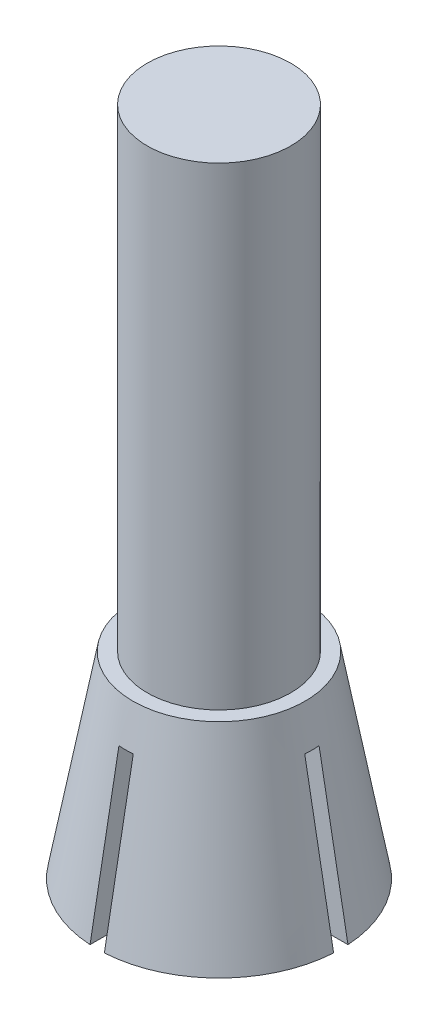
from build123d import *

# Parameters (mm, degrees)
ENL_V_MAT_EXTRU_1_DEPTH = 5.5


with BuildPart() as part:
    # Esquisse1 → R_volution1 (revolve)
    with BuildSketch(Plane.XY, mode=Mode.PRIVATE) as r_volution1_sk:
        Polygon((0, 6.75), (0, 23.35), (2.5, 23.35), (2.5, 6.85), (3, 6.85), (4.25, 0), (1.57, 0), (1.57, 6.75), align=None)
    revolve(r_volution1_sk.sketch.rotate(Axis((0, 0, 0), (0, 1, 0)), 90), axis=Axis((0, 0, 0), (0, 1, 0)))

    # Esquisse2 → Enl_v. mat.-Extru.1 (cut)
    with BuildSketch(Plane.XZ):
        Polygon((-0.25, 0.25), (-0.25, 5), (0.25, 5), (0.25, 0.25), (5, 0.25), (5, -0.25), (0.25, -0.25), (0.25, -5), (-0.25, -5), (-0.25, -0.25), (-5, -0.25), (-5, 0.25), align=None)
    extrude(amount=-ENL_V_MAT_EXTRU_1_DEPTH, mode=Mode.SUBTRACT)


solid = part.part
